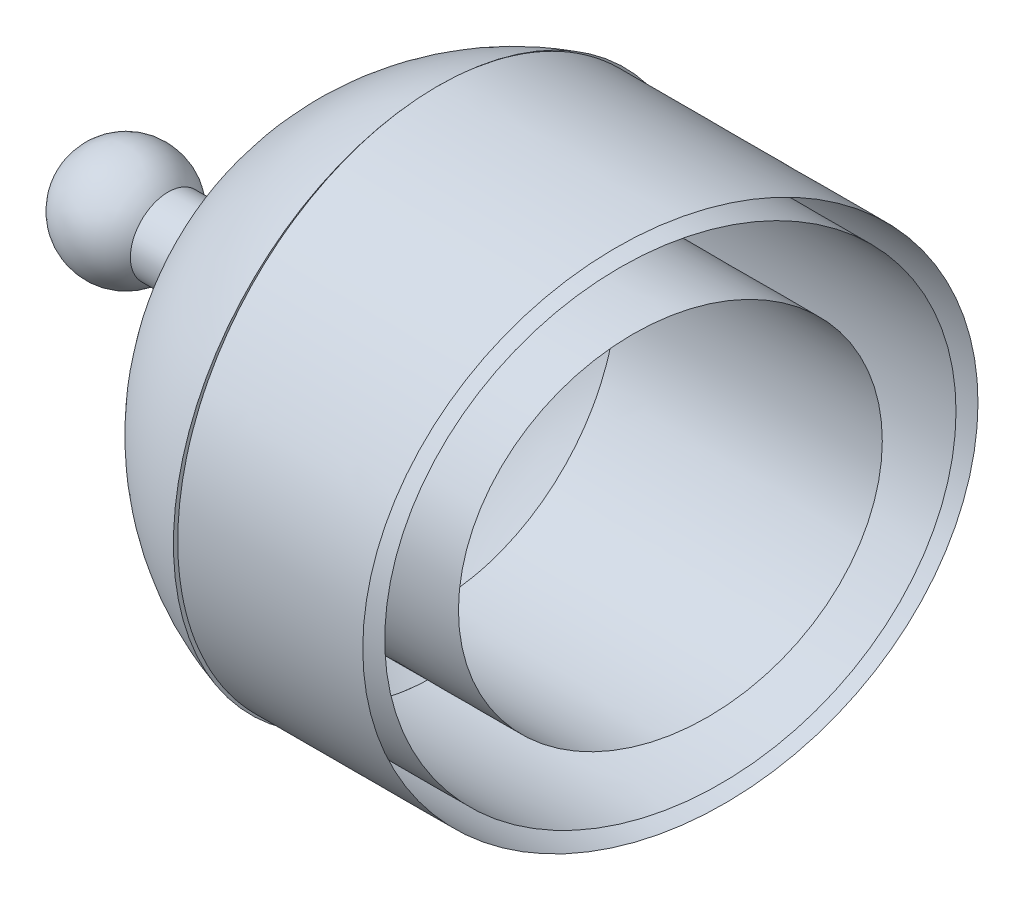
ISO-10303-21;
HEADER;
FILE_DESCRIPTION(('STEP AP214'),'2;1');
FILE_NAME('part.step','',(''),(''),'','','');
FILE_SCHEMA(('AUTOMOTIVE_DESIGN { 1 0 10303 214 1 1 1 1 }'));
ENDSEC;
DATA;
#1=APPLICATION_CONTEXT('core data for automotive mechanical design processes');
#2=APPLICATION_PROTOCOL_DEFINITION('international standard','automotive_design',2000,#1);
#3=PRODUCT_CONTEXT('',#1,'mechanical');
#4=PRODUCT('Part','Part','',(#3));
#5=PRODUCT_RELATED_PRODUCT_CATEGORY('part','',(#4));
#6=PRODUCT_DEFINITION_FORMATION('','',#4);
#7=PRODUCT_DEFINITION_CONTEXT('part definition',#1,'design');
#8=PRODUCT_DEFINITION('design','',#6,#7);
#9=PRODUCT_DEFINITION_SHAPE('','',#8);
#10=(LENGTH_UNIT() NAMED_UNIT(*) SI_UNIT(.MILLI.,.METRE.));
#11=(NAMED_UNIT(*) PLANE_ANGLE_UNIT() SI_UNIT($,.RADIAN.));
#12=(NAMED_UNIT(*) SI_UNIT($,.STERADIAN.) SOLID_ANGLE_UNIT());
#13=UNCERTAINTY_MEASURE_WITH_UNIT(LENGTH_MEASURE(1.E-05),#10,'distance_accuracy_value','');
#14=(GEOMETRIC_REPRESENTATION_CONTEXT(3) GLOBAL_UNCERTAINTY_ASSIGNED_CONTEXT((#13)) GLOBAL_UNIT_ASSIGNED_CONTEXT((#10,
#11,#12)) REPRESENTATION_CONTEXT('',''));
#15=CARTESIAN_POINT('',(0.,0.,0.));
#16=DIRECTION('',(0.,0.,1.));
#17=DIRECTION('',(1.,0.,0.));
#18=AXIS2_PLACEMENT_3D('',#15,#16,#17);
#19=CARTESIAN_POINT('',(6.93653758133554,0.,0.));
#20=DIRECTION('',(0.983583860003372,-0.00254509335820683,0.180433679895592));
#21=DIRECTION('',(0.18043426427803,0.,-0.983587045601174));
#22=AXIS2_PLACEMENT_3D('',#19,#20,#21);
#23=CIRCLE('',#22,3.50000000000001);
#24=DIRECTION('',(-1.,0.,0.));
#25=VECTOR('',#24,1.);
#26=SURFACE_OF_LINEAR_EXTRUSION('',#23,#25);
#27=CARTESIAN_POINT('',(7.56805750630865,0.,-3.44255465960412));
#28=VERTEX_POINT('',#27);
#29=EDGE_CURVE('E48',#28,#28,#23,.T.);
#30=ORIENTED_EDGE('',*,*,#29,.T.);
#31=EDGE_LOOP('',(#30));
#32=FACE_BOUND('',#31,.T.);
#33=CARTESIAN_POINT('',(3.85486874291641,0.,-3.44255465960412));
#34=CARTESIAN_POINT('',(3.85486874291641,-0.0978764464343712,-3.44260255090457));
#35=CARTESIAN_POINT('',(3.85486874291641,-0.195724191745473,-3.43860718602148));
#36=CARTESIAN_POINT('',(3.85486874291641,-0.391094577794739,-3.42253563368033));
#37=CARTESIAN_POINT('',(3.85486874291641,-0.488615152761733,-3.41043343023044));
#38=CARTESIAN_POINT('',(3.85486874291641,-0.682335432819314,-3.3781994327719));
#39=CARTESIAN_POINT('',(3.85486874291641,-0.778534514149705,-3.35806397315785));
#40=CARTESIAN_POINT('',(3.85486874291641,-1.06373496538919,-3.28585584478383));
#41=CARTESIAN_POINT('',(3.85486874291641,-1.24989076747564,-3.22193567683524));
#42=CARTESIAN_POINT('',(3.85486874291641,-1.60780020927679,-3.06460947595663));
#43=CARTESIAN_POINT('',(3.85486874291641,-1.77963652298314,-2.97139005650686));
#44=CARTESIAN_POINT('',(3.85486874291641,-2.10423513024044,-2.75850636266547));
#45=CARTESIAN_POINT('',(3.85486874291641,-2.25713271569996,-2.63904888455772));
#46=CARTESIAN_POINT('',(3.85486874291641,-2.5397978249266,-2.37745244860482));
#47=CARTESIAN_POINT('',(3.85486874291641,-2.66974359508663,-2.23550615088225));
#48=CARTESIAN_POINT('',(3.85486874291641,-2.90333664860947,-1.93316582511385));
#49=CARTESIAN_POINT('',(3.85486874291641,-3.00718074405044,-1.77292397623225));
#50=CARTESIAN_POINT('',(3.85486874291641,-3.1862212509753,-1.43851392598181));
#51=CARTESIAN_POINT('',(3.85486874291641,-3.26160178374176,-1.26444436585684));
#52=CARTESIAN_POINT('',(3.85486874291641,-3.38214477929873,-0.907041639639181));
#53=CARTESIAN_POINT('',(3.85486874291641,-3.42744719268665,-0.723755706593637));
#54=CARTESIAN_POINT('',(3.85486874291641,-3.4869685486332,-0.352632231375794));
#55=CARTESIAN_POINT('',(3.85486874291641,-3.50125853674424,-0.164806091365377));
#56=CARTESIAN_POINT('',(3.85486874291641,-3.49854132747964,0.21061807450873));
#57=CARTESIAN_POINT('',(3.85486874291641,-3.48153410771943,0.39821610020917));
#58=CARTESIAN_POINT('',(3.85486874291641,-3.41673929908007,0.768016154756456));
#59=CARTESIAN_POINT('',(3.85486874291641,-3.36895225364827,0.950218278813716));
#60=CARTESIAN_POINT('',(3.85486874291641,-3.24406068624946,1.30423818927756));
#61=CARTESIAN_POINT('',(3.85486874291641,-3.16695715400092,1.47605632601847));
#62=CARTESIAN_POINT('',(3.85486874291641,-2.98562311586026,1.80481309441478));
#63=CARTESIAN_POINT('',(3.85486874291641,-2.88139384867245,1.9617524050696));
#64=CARTESIAN_POINT('',(3.85486874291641,-2.70712214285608,2.18277830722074));
#65=CARTESIAN_POINT('',(3.85486874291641,-2.64601289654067,2.25408451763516));
#66=CARTESIAN_POINT('',(3.85486874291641,-2.51821336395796,2.39150993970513));
#67=CARTESIAN_POINT('',(3.85486874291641,-2.45152424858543,2.45763023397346));
#68=CARTESIAN_POINT('',(3.85486874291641,-2.31304838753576,2.58423829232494));
#69=CARTESIAN_POINT('',(3.85486874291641,-2.24126365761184,2.6447282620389));
#70=CARTESIAN_POINT('',(3.85486874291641,-2.0930169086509,2.75978030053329));
#71=CARTESIAN_POINT('',(3.85486874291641,-2.01655089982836,2.81433719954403));
#72=CARTESIAN_POINT('',(3.85486874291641,-1.77897037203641,2.96982026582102));
#73=CARTESIAN_POINT('',(3.85486874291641,-1.61134826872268,3.0610287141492));
#74=CARTESIAN_POINT('',(3.85486874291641,-1.26359874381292,3.21526590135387));
#75=CARTESIAN_POINT('',(3.85486874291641,-1.08346979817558,3.27829119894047));
#76=CARTESIAN_POINT('',(3.85486874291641,-0.804939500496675,3.35129485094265));
#77=CARTESIAN_POINT('',(3.85486874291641,-0.709275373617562,3.37217547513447));
#78=CARTESIAN_POINT('',(3.85486874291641,-0.516619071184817,3.40596573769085));
#79=CARTESIAN_POINT('',(3.85486874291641,-0.419628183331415,3.41888261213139));
#80=CARTESIAN_POINT('',(3.85486874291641,-0.224878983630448,3.43668473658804));
#81=CARTESIAN_POINT('',(3.85486874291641,-0.127120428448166,3.44156732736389));
#82=CARTESIAN_POINT('',(3.85486874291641,0.0684646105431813,3.44327333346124));
#83=CARTESIAN_POINT('',(3.85486874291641,0.166291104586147,3.44009496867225));
#84=CARTESIAN_POINT('',(3.85486874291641,0.458833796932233,3.41845936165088));
#85=CARTESIAN_POINT('',(3.85486874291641,0.652801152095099,3.38791862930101));
#86=CARTESIAN_POINT('',(3.85486874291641,1.03297057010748,3.29532558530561));
#87=CARTESIAN_POINT('',(3.85486874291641,1.21917243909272,3.23327248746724));
#88=CARTESIAN_POINT('',(3.85486874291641,1.57813185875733,3.07947171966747));
#89=CARTESIAN_POINT('',(3.85486874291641,1.75093504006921,2.98783086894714));
#90=CARTESIAN_POINT('',(3.85486874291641,2.07768173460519,2.77791531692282));
#91=CARTESIAN_POINT('',(3.85486874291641,2.23175809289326,2.65984745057));
#92=CARTESIAN_POINT('',(3.85486874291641,2.51699521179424,2.4008018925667));
#93=CARTESIAN_POINT('',(3.85486874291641,2.64833226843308,2.26001847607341));
#94=CARTESIAN_POINT('',(3.85486874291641,2.88486255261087,1.95975551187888));
#95=CARTESIAN_POINT('',(3.85486874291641,2.99025235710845,1.80043091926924));
#96=CARTESIAN_POINT('',(3.85486874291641,3.17249630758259,1.46759477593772));
#97=CARTESIAN_POINT('',(3.85486874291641,3.24953616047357,1.29418497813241));
#98=CARTESIAN_POINT('',(3.85486874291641,3.37346698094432,0.937836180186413));
#99=CARTESIAN_POINT('',(3.85486874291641,3.42050114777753,0.754947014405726));
#100=CARTESIAN_POINT('',(3.85486874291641,3.48351722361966,0.38435030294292));
#101=CARTESIAN_POINT('',(3.85486874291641,3.49957454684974,0.19665558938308));
#102=CARTESIAN_POINT('',(3.85486874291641,3.50038695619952,-0.1788004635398));
#103=CARTESIAN_POINT('',(3.85486874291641,3.48514198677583,-0.366561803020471));
#104=CARTESIAN_POINT('',(3.85486874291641,3.42381340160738,-0.736976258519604));
#105=CARTESIAN_POINT('',(3.85486874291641,3.37773029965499,-0.919629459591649));
#106=CARTESIAN_POINT('',(3.85486874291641,3.25613843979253,-1.27482145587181));
#107=CARTESIAN_POINT('',(3.85486874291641,3.18063065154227,-1.44736058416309));
#108=CARTESIAN_POINT('',(3.85486874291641,3.00233703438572,-1.77780371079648));
#109=CARTESIAN_POINT('',(3.85486874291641,2.89955243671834,-1.93570836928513));
#110=CARTESIAN_POINT('',(3.85486874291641,2.72730729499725,-2.15833756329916));
#111=CARTESIAN_POINT('',(3.85486874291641,2.6668511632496,-2.23020366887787));
#112=CARTESIAN_POINT('',(3.85486874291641,2.54030487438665,-2.36880046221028));
#113=CARTESIAN_POINT('',(3.85486874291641,2.47421564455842,-2.43553199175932));
#114=CARTESIAN_POINT('',(3.85486874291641,2.3368799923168,-2.56341033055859));
#115=CARTESIAN_POINT('',(3.85486874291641,2.26563523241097,-2.62455892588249));
#116=CARTESIAN_POINT('',(3.85486874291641,2.11842664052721,-2.74095496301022));
#117=CARTESIAN_POINT('',(3.85486874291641,2.04245965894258,-2.79619839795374));
#118=CARTESIAN_POINT('',(3.85486874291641,1.80636367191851,-2.95376668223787));
#119=CARTESIAN_POINT('',(3.85486874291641,1.63963825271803,-3.04644225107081));
#120=CARTESIAN_POINT('',(3.85486874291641,1.29329922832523,-3.20381942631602));
#121=CARTESIAN_POINT('',(3.85486874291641,1.11367019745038,-3.2684868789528));
#122=CARTESIAN_POINT('',(3.85486874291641,0.778559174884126,-3.35950577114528));
#123=CARTESIAN_POINT('',(3.85486874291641,0.624339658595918,-3.39057681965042));
#124=CARTESIAN_POINT('',(3.85486874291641,0.313385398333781,-3.43204352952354));
#125=CARTESIAN_POINT('',(3.85486874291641,0.156655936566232,-3.44247800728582));
#126=CARTESIAN_POINT('',(3.85486874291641,0.,-3.44255465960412));
#127=B_SPLINE_CURVE_WITH_KNOTS('',3,(#33,#34,#35,#36,#37,#38,#39,#40,#41,#42,#43,#44,#45,#46,
#47,#48,#49,#50,#51,#52,#53,#54,#55,#56,#57,#58,#59,#60,#61,#62,#63,#64,#65,#66,#67,#68,#69,#70,
#71,#72,#73,#74,#75,#76,#77,#78,#79,#80,#81,#82,#83,#84,#85,#86,#87,#88,#89,#90,#91,#92,#93,#94,
#95,#96,#97,#98,#99,#100,#101,#102,#103,#104,#105,#106,#107,#108,#109,#110,#111,#112,#113,#114,
#115,#116,#117,#118,#119,#120,#121,#122,#123,#124,#125,#126),.UNSPECIFIED.,.T.,.F.,(4,2,2,2,2,2,
2,2,2,2,2,2,2,2,2,2,2,2,2,2,2,2,2,2,2,2,2,2,2,2,2,2,2,2,2,2,2,2,2,2,2,2,2,2,2,2,4),(0.,
0.293496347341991,0.587939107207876,0.882516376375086,1.47003173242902,2.05387841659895,
2.63327883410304,3.20796016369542,3.77816869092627,4.34462282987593,4.90842248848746,
5.47092918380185,6.03343628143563,6.59593344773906,7.15841162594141,7.72086412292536,
8.00233714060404,8.28375124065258,8.56505463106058,8.84660120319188,9.41642042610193,
9.98630920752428,10.2797757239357,10.572975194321,10.8662716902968,11.1596329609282,
11.7457961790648,12.3319740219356,12.9160588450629,13.4957228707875,14.0706692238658,
14.6411155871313,15.2077557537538,15.7716710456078,16.3342117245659,16.8967534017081,
17.4592857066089,18.0217994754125,18.5842878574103,18.8657727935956,19.1472114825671,
19.4285598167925,19.7100978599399,20.2796480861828,20.8498908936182,21.3205319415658,
21.7902868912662),.UNSPECIFIED.);
#128=CARTESIAN_POINT('',(3.85486874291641,0.,-3.44255465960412));
#129=VERTEX_POINT('',#128);
#130=EDGE_CURVE('E11',#129,#129,#127,.T.);
#131=ORIENTED_EDGE('',*,*,#130,.T.);
#132=EDGE_LOOP('',(#131));
#133=FACE_BOUND('',#132,.T.);
#134=ADVANCED_FACE('F40',(#32,#133),#26,.T.);
#135=OPEN_SHELL('',(#134));
#136=SHELL_BASED_SURFACE_MODEL('B2',(#135));
#137=CARTESIAN_POINT('',(6.93653758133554,0.,0.));
#138=DIRECTION('',(0.983583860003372,-0.00254509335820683,0.180433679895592));
#139=DIRECTION('',(0.18043426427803,0.,-0.983587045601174));
#140=AXIS2_PLACEMENT_3D('',#137,#138,#139);
#141=CIRCLE('',#140,2.41126843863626);
#142=DIRECTION('',(-1.,0.,0.));
#143=VECTOR('',#142,1.);
#144=SURFACE_OF_LINEAR_EXTRUSION('',#141,#143);
#145=CARTESIAN_POINT('',(7.37161302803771,0.,-2.3716923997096));
#146=VERTEX_POINT('',#145);
#147=EDGE_CURVE('E87',#146,#146,#141,.T.);
#148=ORIENTED_EDGE('',*,*,#147,.T.);
#149=EDGE_LOOP('',(#148));
#150=FACE_BOUND('',#149,.T.);
#151=CARTESIAN_POINT('',(3.85486874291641,0.,-2.37169239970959));
#152=CARTESIAN_POINT('',(3.85486874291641,-0.0674249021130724,-2.3717269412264));
#153=CARTESIAN_POINT('',(3.85486874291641,-0.134824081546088,-2.36897760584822));
#154=CARTESIAN_POINT('',(3.85486874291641,-0.336794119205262,-2.35235305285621));
#155=CARTESIAN_POINT('',(3.85486874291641,-0.470785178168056,-2.33007219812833));
#156=CARTESIAN_POINT('',(3.85486874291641,-0.732942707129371,-2.26372589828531));
#157=CARTESIAN_POINT('',(3.85486874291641,-0.861118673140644,-2.21969747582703));
#158=CARTESIAN_POINT('',(3.85486874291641,-1.10764151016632,-2.11131619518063));
#159=CARTESIAN_POINT('',(3.85486874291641,-1.22604475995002,-2.04709196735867));
#160=CARTESIAN_POINT('',(3.85486874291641,-1.44968579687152,-1.90042757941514));
#161=CARTESIAN_POINT('',(3.85486874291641,-1.55501697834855,-1.81812986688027));
#162=CARTESIAN_POINT('',(3.85486874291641,-1.74975081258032,-1.63790765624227));
#163=CARTESIAN_POINT('',(3.85486874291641,-1.83927621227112,-1.54011589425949));
#164=CARTESIAN_POINT('',(3.85486874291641,-2.00020735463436,-1.33182329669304));
#165=CARTESIAN_POINT('',(3.85486874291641,-2.071748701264,-1.22142730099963));
#166=CARTESIAN_POINT('',(3.85486874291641,-2.19509551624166,-0.991040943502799));
#167=CARTESIAN_POINT('',(3.85486874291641,-2.24702782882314,-0.871118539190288));
#168=CARTESIAN_POINT('',(3.85486874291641,-2.33007400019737,-0.62489165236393));
#169=CARTESIAN_POINT('',(3.85486874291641,-2.3612842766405,-0.498619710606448));
#170=CARTESIAN_POINT('',(3.85486874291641,-2.40229070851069,-0.242940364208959));
#171=CARTESIAN_POINT('',(3.85486874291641,-2.41213580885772,-0.113540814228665));
#172=CARTESIAN_POINT('',(3.85486874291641,-2.41026318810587,0.145102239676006));
#173=CARTESIAN_POINT('',(3.85486874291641,-2.3985454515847,0.27434574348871));
#174=CARTESIAN_POINT('',(3.85486874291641,-2.35390853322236,0.529111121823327));
#175=CARTESIAN_POINT('',(3.85486874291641,-2.32098972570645,0.654633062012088));
#176=CARTESIAN_POINT('',(3.85486874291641,-2.23493867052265,0.898538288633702));
#177=CARTESIAN_POINT('',(3.85486874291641,-2.18180710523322,1.01692181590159));
#178=CARTESIAN_POINT('',(3.85486874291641,-2.056913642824,1.24338015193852));
#179=CARTESIAN_POINT('',(3.85486874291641,-1.98515259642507,1.35145543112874));
#180=CARTESIAN_POINT('',(3.85486874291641,-1.82499561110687,1.55454476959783));
#181=CARTESIAN_POINT('',(3.85486874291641,-1.73660054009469,1.64955950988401));
#182=CARTESIAN_POINT('',(3.85486874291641,-1.5935265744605,1.78038273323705));
#183=CARTESIAN_POINT('',(3.85486874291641,-1.54407943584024,1.82204650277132));
#184=CARTESIAN_POINT('',(3.85486874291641,-1.44195311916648,1.9013023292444));
#185=CARTESIAN_POINT('',(3.85486874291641,-1.38927118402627,1.93889083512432));
#186=CARTESIAN_POINT('',(3.85486874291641,-1.22559080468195,2.04601230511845));
#187=CARTESIAN_POINT('',(3.85486874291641,-1.11011180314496,2.10884695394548));
#188=CARTESIAN_POINT('',(3.85486874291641,-0.870536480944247,2.21510479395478));
#189=CARTESIAN_POINT('',(3.85486874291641,-0.746439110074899,2.25852561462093));
#190=CARTESIAN_POINT('',(3.85486874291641,-0.554550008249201,2.30882049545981));
#191=CARTESIAN_POINT('',(3.85486874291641,-0.488643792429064,2.32320581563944));
#192=CARTESIAN_POINT('',(3.85486874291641,-0.355916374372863,2.34648503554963));
#193=CARTESIAN_POINT('',(3.85486874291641,-0.289096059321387,2.35538392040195));
#194=CARTESIAN_POINT('',(3.85486874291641,-0.154926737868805,2.3676484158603));
#195=CARTESIAN_POINT('',(3.85486874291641,-0.0875775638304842,2.3710121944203));
#196=CARTESIAN_POINT('',(3.85486874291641,0.0471675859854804,2.37218751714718));
#197=CARTESIAN_POINT('',(3.85486874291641,0.114563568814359,2.36999783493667));
#198=CARTESIAN_POINT('',(3.85486874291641,0.316106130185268,2.35509233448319));
#199=CARTESIAN_POINT('',(3.85486874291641,0.449736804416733,2.33405178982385));
#200=CARTESIAN_POINT('',(3.85486874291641,0.711648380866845,2.27026130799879));
#201=CARTESIAN_POINT('',(3.85486874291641,0.839929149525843,2.22751082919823));
#202=CARTESIAN_POINT('',(3.85486874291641,1.08722844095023,2.12155227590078));
#203=CARTESIAN_POINT('',(3.85486874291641,1.20627840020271,2.05841779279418));
#204=CARTESIAN_POINT('',(3.85486874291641,1.4313852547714,1.91379986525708));
#205=CARTESIAN_POINT('',(3.85486874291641,1.53753367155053,1.83245891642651));
#206=CARTESIAN_POINT('',(3.85486874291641,1.73404317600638,1.65399366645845));
#207=CARTESIAN_POINT('',(3.85486874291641,1.82452571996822,1.55700320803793));
#208=CARTESIAN_POINT('',(3.85486874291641,1.98747943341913,1.35014188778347));
#209=CARTESIAN_POINT('',(3.85486874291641,2.06008603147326,1.24037777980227));
#210=CARTESIAN_POINT('',(3.85486874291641,2.18564006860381,1.01107571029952));
#211=CARTESIAN_POINT('',(3.85486874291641,2.23871544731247,0.891607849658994));
#212=CARTESIAN_POINT('',(3.85486874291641,2.32409553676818,0.646107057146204));
#213=CARTESIAN_POINT('',(3.85486874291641,2.35649890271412,0.520108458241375));
#214=CARTESIAN_POINT('',(3.85486874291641,2.39991298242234,0.264792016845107));
#215=CARTESIAN_POINT('',(3.85486874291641,2.41097565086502,0.135483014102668));
#216=CARTESIAN_POINT('',(3.85486874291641,2.41153470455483,-0.123182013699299));
#217=CARTESIAN_POINT('',(3.85486874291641,2.40103105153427,-0.252538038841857));
#218=CARTESIAN_POINT('',(3.85486874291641,2.35878211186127,-0.507726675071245));
#219=CARTESIAN_POINT('',(3.85486874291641,2.32703717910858,-0.633559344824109));
#220=CARTESIAN_POINT('',(3.85486874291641,2.24325948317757,-0.878272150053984));
#221=CARTESIAN_POINT('',(3.85486874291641,2.19122738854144,-0.997152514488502));
#222=CARTESIAN_POINT('',(3.85486874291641,2.06842827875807,-1.22477230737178));
#223=CARTESIAN_POINT('',(3.85486874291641,1.99766210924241,-1.33351219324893));
#224=CARTESIAN_POINT('',(3.85486874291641,1.83936604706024,-1.53807653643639));
#225=CARTESIAN_POINT('',(3.85486874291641,1.75183702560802,-1.63390166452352));
#226=CARTESIAN_POINT('',(3.85486874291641,1.60994506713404,-1.76603376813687));
#227=CARTESIAN_POINT('',(3.85486874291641,1.56086986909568,-1.80815119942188));
#228=CARTESIAN_POINT('',(3.85486874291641,1.45945871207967,-1.88833288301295));
#229=CARTESIAN_POINT('',(3.85486874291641,1.40712057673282,-1.92639438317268));
#230=CARTESIAN_POINT('',(3.85486874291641,1.2444630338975,-2.03495248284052));
#231=CARTESIAN_POINT('',(3.85486874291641,1.12960194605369,-2.09879792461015));
#232=CARTESIAN_POINT('',(3.85486874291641,0.890997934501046,-2.20721885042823));
#233=CARTESIAN_POINT('',(3.85486874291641,0.767244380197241,-2.25177080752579));
#234=CARTESIAN_POINT('',(3.85486874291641,0.536376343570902,-2.31447754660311));
#235=CARTESIAN_POINT('',(3.85486874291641,0.430131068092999,-2.33588381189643));
#236=CARTESIAN_POINT('',(3.85486874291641,0.215899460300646,-2.36445022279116));
#237=CARTESIAN_POINT('',(3.85486874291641,0.10791678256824,-2.37163711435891));
#238=CARTESIAN_POINT('',(3.85486874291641,0.,-2.37169239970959));
#239=B_SPLINE_CURVE_WITH_KNOTS('',3,(#151,#152,#153,#154,#155,#156,#157,#158,#159,#160,#161,
#162,#163,#164,#165,#166,#167,#168,#169,#170,#171,#172,#173,#174,#175,#176,#177,#178,#179,#180,
#181,#182,#183,#184,#185,#186,#187,#188,#189,#190,#191,#192,#193,#194,#195,#196,#197,#198,#199,
#200,#201,#202,#203,#204,#205,#206,#207,#208,#209,#210,#211,#212,#213,#214,#215,#216,#217,#218,
#219,#220,#221,#222,#223,#224,#225,#226,#227,#228,#229,#230,#231,#232,#233,#234,#235,#236,#237,
#238),.UNSPECIFIED.,.T.,.F.,(4,2,2,2,2,2,2,2,2,2,2,2,2,2,2,2,2,2,2,2,2,2,2,2,2,2,2,2,2,2,2,2,2,
2,2,2,2,2,2,2,2,2,2,4),(0.,0.202199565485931,0.607646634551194,1.01240584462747,
1.41463758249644,1.81380613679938,2.20972355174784,2.60255950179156,2.99280892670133,
3.38122959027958,3.76875948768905,4.15628966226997,4.54381299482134,4.93132324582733,
5.31881580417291,5.70628815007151,5.9000875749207,6.09405453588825,6.48662228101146,
6.87923794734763,7.08141696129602,7.28341199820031,7.48547387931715,7.68758038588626,
8.09140806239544,8.49524581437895,8.89764161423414,9.29699177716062,9.69309177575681,
10.0860915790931,10.4764691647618,10.8649694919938,11.2525228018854,11.6400767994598,
12.0276243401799,12.4151591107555,12.8026763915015,13.190173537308,13.3840039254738,
13.5779650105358,13.9703474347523,14.3632070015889,14.6874475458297,15.0110776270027),.UNSPECIFIED.);
#240=CARTESIAN_POINT('',(3.85486874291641,0.,-2.37169239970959));
#241=VERTEX_POINT('',#240);
#242=EDGE_CURVE('E39',#241,#241,#239,.T.);
#243=ORIENTED_EDGE('',*,*,#242,.T.);
#244=EDGE_LOOP('',(#243));
#245=FACE_BOUND('',#244,.T.);
#246=ADVANCED_FACE('F79',(#150,#245),#144,.T.);
#247=OPEN_SHELL('',(#246));
#248=SHELL_BASED_SURFACE_MODEL('B6',(#247));
#249=CARTESIAN_POINT('',(6.93653758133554,0.,0.));
#250=DIRECTION('',(0.983583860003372,-0.00254509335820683,0.180433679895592));
#251=DIRECTION('',(0.18043426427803,0.,-0.983587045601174));
#252=AXIS2_PLACEMENT_3D('',#249,#250,#251);
#253=CIRCLE('',#252,3.25);
#254=DIRECTION('',(-1.,0.,0.));
#255=VECTOR('',#254,1.);
#256=SURFACE_OF_LINEAR_EXTRUSION('',#253,#255);
#257=CARTESIAN_POINT('',(7.52294894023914,0.,-3.19665789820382));
#258=VERTEX_POINT('',#257);
#259=EDGE_CURVE('E125',#258,#258,#253,.T.);
#260=ORIENTED_EDGE('',*,*,#259,.T.);
#261=EDGE_LOOP('',(#260));
#262=FACE_BOUND('',#261,.T.);
#263=CARTESIAN_POINT('',(3.85486874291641,0.,-3.19665789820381));
#264=CARTESIAN_POINT('',(3.85486874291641,-0.0908778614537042,-3.19670444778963));
#265=CARTESIAN_POINT('',(3.85486874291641,-0.181721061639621,-3.1929987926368));
#266=CARTESIAN_POINT('',(3.85486874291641,-0.45394402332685,-3.17059159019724));
#267=CARTESIAN_POINT('',(3.85486874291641,-0.634542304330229,-3.14056059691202));
#268=CARTESIAN_POINT('',(3.85486874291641,-0.98788826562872,-3.0511365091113));
#269=CARTESIAN_POINT('',(3.85486874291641,-1.16064874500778,-2.99179331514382));
#270=CARTESIAN_POINT('',(3.85486874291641,-1.4929216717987,-2.84571287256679));
#271=CARTESIAN_POINT('',(3.85486874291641,-1.65251010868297,-2.75914899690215));
#272=CARTESIAN_POINT('',(3.85486874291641,-1.95394206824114,-2.56146911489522));
#273=CARTESIAN_POINT('',(3.85486874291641,-2.09591147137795,-2.45054510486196));
#274=CARTESIAN_POINT('',(3.85486874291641,-2.35838119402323,-2.20763470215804));
#275=CARTESIAN_POINT('',(3.85486874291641,-2.47904695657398,-2.07582721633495));
#276=CARTESIAN_POINT('',(3.85486874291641,-2.69595612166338,-1.79508247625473));
#277=CARTESIAN_POINT('',(3.85486874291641,-2.79238229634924,-1.64628652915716));
#278=CARTESIAN_POINT('',(3.85486874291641,-2.9586338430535,-1.33576295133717));
#279=CARTESIAN_POINT('',(3.85486874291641,-3.02863018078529,-1.17412691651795));
#280=CARTESIAN_POINT('',(3.85486874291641,-3.14056305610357,-0.842252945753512));
#281=CARTESIAN_POINT('',(3.85486874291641,-3.18262954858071,-0.672058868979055));
#282=CARTESIAN_POINT('',(3.85486874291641,-3.23789935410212,-0.327444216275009));
#283=CARTESIAN_POINT('',(3.85486874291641,-3.25116863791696,-0.153034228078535));
#284=CARTESIAN_POINT('',(3.85486874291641,-3.24864552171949,0.195573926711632));
#285=CARTESIAN_POINT('',(3.85486874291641,-3.23285310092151,0.369772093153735));
#286=CARTESIAN_POINT('',(3.85486874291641,-3.17268649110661,0.713157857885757));
#287=CARTESIAN_POINT('',(3.85486874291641,-3.12831280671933,0.88234554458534));
#288=CARTESIAN_POINT('',(3.85486874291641,-3.01234206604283,1.21107831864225));
#289=CARTESIAN_POINT('',(3.85486874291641,-2.94074592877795,1.37062373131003));
#290=CARTESIAN_POINT('',(3.85486874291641,-2.77236432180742,1.67589787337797));
#291=CARTESIAN_POINT('',(3.85486874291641,-2.67558000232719,1.82162723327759));
#292=CARTESIAN_POINT('',(3.85486874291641,-2.51375627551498,2.02686557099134));
#293=CARTESIAN_POINT('',(3.85486874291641,-2.45701197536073,2.09307848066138));
#294=CARTESIAN_POINT('',(3.85486874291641,-2.33834098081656,2.22068780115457));
#295=CARTESIAN_POINT('',(3.85486874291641,-2.27641537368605,2.28208521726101));
#296=CARTESIAN_POINT('',(3.85486874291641,-2.14783064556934,2.39964984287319));
#297=CARTESIAN_POINT('',(3.85486874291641,-2.08117339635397,2.45581910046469));
#298=CARTESIAN_POINT('',(3.85486874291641,-1.94351570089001,2.56265313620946));
#299=CARTESIAN_POINT('',(3.85486874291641,-1.87251154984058,2.6133131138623));
#300=CARTESIAN_POINT('',(3.85486874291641,-1.65190105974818,2.7576902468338));
#301=CARTESIAN_POINT('',(3.85486874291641,-1.49625196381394,2.84238380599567));
#302=CARTESIAN_POINT('',(3.85486874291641,-1.17334169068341,2.98560405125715));
#303=CARTESIAN_POINT('',(3.85486874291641,-1.00607909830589,3.04412754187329));
#304=CARTESIAN_POINT('',(3.85486874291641,-0.747443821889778,3.11191664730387));
#305=CARTESIAN_POINT('',(3.85486874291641,-0.6586128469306,3.13130579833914));
#306=CARTESIAN_POINT('',(3.85486874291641,-0.479717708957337,3.16268247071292));
#307=CARTESIAN_POINT('',(3.85486874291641,-0.389654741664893,3.17467671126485));
#308=CARTESIAN_POINT('',(3.85486874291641,-0.208816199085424,3.19120725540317));
#309=CARTESIAN_POINT('',(3.85486874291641,-0.118040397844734,3.19574108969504));
#310=CARTESIAN_POINT('',(3.85486874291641,0.0635742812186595,3.197325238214));
#311=CARTESIAN_POINT('',(3.85486874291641,0.154413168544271,3.19437389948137));
#312=CARTESIAN_POINT('',(3.85486874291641,0.426059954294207,3.17428369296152));
#313=CARTESIAN_POINT('',(3.85486874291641,0.60617249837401,3.14592444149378));
#314=CARTESIAN_POINT('',(3.85486874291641,0.959186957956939,3.05994518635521));
#315=CARTESIAN_POINT('',(3.85486874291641,1.13208869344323,3.00232445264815));
#316=CARTESIAN_POINT('',(3.85486874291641,1.46540815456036,2.85950945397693));
#317=CARTESIAN_POINT('',(3.85486874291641,1.62586825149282,2.77441437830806));
#318=CARTESIAN_POINT('',(3.85486874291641,1.9292758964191,2.57949279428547));
#319=CARTESIAN_POINT('',(3.85486874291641,2.07234680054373,2.46985834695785));
#320=CARTESIAN_POINT('',(3.85486874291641,2.33720983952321,2.22931604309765));
#321=CARTESIAN_POINT('',(3.85486874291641,2.4591656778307,2.09858858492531));
#322=CARTESIAN_POINT('',(3.85486874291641,2.67880094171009,1.8197729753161));
#323=CARTESIAN_POINT('',(3.85486874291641,2.7766629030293,1.67182871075));
#324=CARTESIAN_POINT('',(3.85486874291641,2.9458894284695,1.36276657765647));
#325=CARTESIAN_POINT('',(3.85486874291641,3.01742643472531,1.20174319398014));
#326=CARTESIAN_POINT('',(3.85486874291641,3.13250505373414,0.870847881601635));
#327=CARTESIAN_POINT('',(3.85486874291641,3.17617963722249,0.701022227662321));
#328=CARTESIAN_POINT('',(3.85486874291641,3.23469456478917,0.356896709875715));
#329=CARTESIAN_POINT('',(3.85486874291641,3.24960493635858,0.182608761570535));
#330=CARTESIAN_POINT('',(3.85486874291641,3.25035931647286,-0.166029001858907));
#331=CARTESIAN_POINT('',(3.85486874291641,3.2362032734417,-0.340378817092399));
#332=CARTESIAN_POINT('',(3.85486874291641,3.17925530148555,-0.6843350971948));
#333=CARTESIAN_POINT('',(3.85486874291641,3.13646384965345,-0.853941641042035));
#334=CARTESIAN_POINT('',(3.85486874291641,3.02355712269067,-1.18376278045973));
#335=CARTESIAN_POINT('',(3.85486874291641,2.95344274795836,-1.3439776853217));
#336=CARTESIAN_POINT('',(3.85486874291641,2.78788438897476,-1.65081773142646));
#337=CARTESIAN_POINT('',(3.85486874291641,2.69244154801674,-1.79744348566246));
#338=CARTESIAN_POINT('',(3.85486874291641,2.53249963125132,-2.00417059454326));
#339=CARTESIAN_POINT('',(3.85486874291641,2.47636179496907,-2.07090340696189));
#340=CARTESIAN_POINT('',(3.85486874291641,2.35885452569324,-2.19960042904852));
#341=CARTESIAN_POINT('',(3.85486874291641,2.29748595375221,-2.2615654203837));
#342=CARTESIAN_POINT('',(3.85486874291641,2.16995999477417,-2.38030959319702));
#343=CARTESIAN_POINT('',(3.85486874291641,2.10380415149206,-2.43709043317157));
#344=CARTESIAN_POINT('',(3.85486874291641,1.96711044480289,-2.54517246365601));
#345=CARTESIAN_POINT('',(3.85486874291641,1.89656965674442,-2.59646993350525));
#346=CARTESIAN_POINT('',(3.85486874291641,1.67733774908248,-2.74278336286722));
#347=CARTESIAN_POINT('',(3.85486874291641,1.52252153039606,-2.82883931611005));
#348=CARTESIAN_POINT('',(3.85486874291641,1.20092041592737,-2.97497509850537));
#349=CARTESIAN_POINT('',(3.85486874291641,1.03412119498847,-3.03502321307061));
#350=CARTESIAN_POINT('',(3.85486874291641,0.722948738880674,-3.11954133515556));
#351=CARTESIAN_POINT('',(3.85486874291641,0.579747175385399,-3.14839366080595));
#352=CARTESIAN_POINT('',(3.85486874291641,0.290997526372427,-3.1868966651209));
#353=CARTESIAN_POINT('',(3.85486874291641,0.145454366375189,-3.19658339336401));
#354=CARTESIAN_POINT('',(3.85486874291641,0.,-3.19665789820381));
#355=B_SPLINE_CURVE_WITH_KNOTS('',3,(#263,#264,#265,#266,#267,#268,#269,#270,#271,#272,#273,
#274,#275,#276,#277,#278,#279,#280,#281,#282,#283,#284,#285,#286,#287,#288,#289,#290,#291,#292,
#293,#294,#295,#296,#297,#298,#299,#300,#301,#302,#303,#304,#305,#306,#307,#308,#309,#310,#311,
#312,#313,#314,#315,#316,#317,#318,#319,#320,#321,#322,#323,#324,#325,#326,#327,#328,#329,#330,
#331,#332,#333,#334,#335,#336,#337,#338,#339,#340,#341,#342,#343,#344,#345,#346,#347,#348,#349,
#350,#351,#352,#353,#354),.UNSPECIFIED.,.T.,.F.,(4,2,2,2,2,2,2,2,2,2,2,2,2,2,2,2,2,2,2,2,2,2,2,
2,2,2,2,2,2,2,2,2,2,2,2,2,2,2,2,2,2,2,2,2,2,4),(0.,0.272532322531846,0.8190094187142,
1.36455939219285,1.90670274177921,2.44471741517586,2.97835007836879,3.50782942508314,
4.03382255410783,4.55735080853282,5.07967845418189,5.60200647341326,6.12432527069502,
6.64662643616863,7.16890375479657,7.43027155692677,7.691584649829,7.95279494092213,
8.21423104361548,8.74334889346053,9.27253133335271,9.54503595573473,9.81729260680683,
10.08963935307,10.3620462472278,10.9063406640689,11.4506486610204,11.9930131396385,
12.5312725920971,13.065151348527,13.5948515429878,14.1210174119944,14.6446530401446,
15.1670122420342,15.6893723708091,16.2117237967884,16.7340580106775,17.256368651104,
17.5177475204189,17.7790834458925,18.0403354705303,18.3017636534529,18.8306317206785,
19.3601428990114,19.7971667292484,20.2333677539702),.UNSPECIFIED.);
#356=CARTESIAN_POINT('',(3.85486874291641,0.,-3.19665789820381));
#357=VERTEX_POINT('',#356);
#358=EDGE_CURVE('E78',#357,#357,#355,.T.);
#359=ORIENTED_EDGE('',*,*,#358,.T.);
#360=EDGE_LOOP('',(#359));
#361=FACE_BOUND('',#360,.T.);
#362=ADVANCED_FACE('F117',(#262,#361),#256,.T.);
#363=OPEN_SHELL('',(#362));
#364=SHELL_BASED_SURFACE_MODEL('B34',(#363));
#365=CARTESIAN_POINT('',(-0.581094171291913,0.,0.));
#366=DIRECTION('',(-1.,0.,0.));
#367=DIRECTION('',(0.,0.,1.));
#368=AXIS2_PLACEMENT_3D('',#365,#366,#367);
#369=CYLINDRICAL_SURFACE('',#368,0.5);
#370=CARTESIAN_POINT('',(0.284931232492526,0.,0.));
#371=DIRECTION('',(-1.,0.,0.));
#372=DIRECTION('',(0.,0.,1.));
#373=AXIS2_PLACEMENT_3D('',#370,#371,#372);
#374=CIRCLE('',#373,0.5);
#375=CARTESIAN_POINT('',(0.284931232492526,0.,0.5));
#376=VERTEX_POINT('',#375);
#377=EDGE_CURVE('E155',#376,#376,#374,.T.);
#378=ORIENTED_EDGE('',*,*,#377,.F.);
#379=EDGE_LOOP('',(#378));
#380=FACE_BOUND('',#379,.T.);
#381=CARTESIAN_POINT('',(1.25304279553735,0.,0.));
#382=DIRECTION('',(1.,0.,0.));
#383=DIRECTION('',(0.,0.,-1.));
#384=AXIS2_PLACEMENT_3D('',#381,#382,#383);
#385=CIRCLE('',#384,0.5);
#386=CARTESIAN_POINT('',(1.25304279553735,0.5,0.));
#387=VERTEX_POINT('',#386);
#388=EDGE_CURVE('E116',#387,#387,#385,.T.);
#389=ORIENTED_EDGE('',*,*,#388,.F.);
#390=EDGE_LOOP('',(#389));
#391=FACE_BOUND('',#390,.T.);
#392=ADVANCED_FACE('F148',(#380,#391),#369,.T.);
#393=CARTESIAN_POINT('',(-0.274085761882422,0.,0.));
#394=DIRECTION('',(-1.,0.,0.));
#395=DIRECTION('',(0.,1.,0.));
#396=AXIS2_PLACEMENT_3D('',#393,#394,#395);
#397=SPHERICAL_SURFACE('',#396,0.75);
#398=ORIENTED_EDGE('',*,*,#377,.T.);
#399=EDGE_LOOP('',(#398));
#400=FACE_BOUND('',#399,.T.);
#401=ADVANCED_FACE('F150',(#400),#397,.T.);
#402=CARTESIAN_POINT('',(4.86002855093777,0.,0.));
#403=DIRECTION('',(-1.,0.,0.));
#404=DIRECTION('',(0.,1.,0.));
#405=AXIS2_PLACEMENT_3D('',#402,#403,#404);
#406=SPHERICAL_SURFACE('',#405,3.64147583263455);
#407=CARTESIAN_POINT('',(3.85486874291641,0.,0.));
#408=DIRECTION('',(-1.,0.,0.));
#409=DIRECTION('',(0.,-1.,0.));
#410=AXIS2_PLACEMENT_3D('',#407,#408,#409);
#411=CIRCLE('',#410,3.5);
#412=CARTESIAN_POINT('',(3.85486874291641,3.5,0.));
#413=VERTEX_POINT('',#412);
#414=EDGE_CURVE('E163',#413,#413,#411,.T.);
#415=CARTESIAN_POINT('',(3.85486874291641,3.5,0.));
#416=CARTESIAN_POINT('',(3.81281787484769,3.48792385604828,0.));
#417=CARTESIAN_POINT('',(3.77098486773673,3.47508919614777,0.));
#418=CARTESIAN_POINT('',(3.68780841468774,3.4479210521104,0.));
#419=CARTESIAN_POINT('',(3.64646496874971,3.43358756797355,0.));
#420=CARTESIAN_POINT('',(3.564321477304,3.40343998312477,0.));
#421=CARTESIAN_POINT('',(3.52352143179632,3.38762588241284,0.));
#422=CARTESIAN_POINT('',(3.44251770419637,3.35453771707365,0.));
#423=CARTESIAN_POINT('',(3.40231402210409,3.33726365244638,0.));
#424=CARTESIAN_POINT('',(3.32255525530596,3.30127796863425,0.));
#425=CARTESIAN_POINT('',(3.28300017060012,3.28256634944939,0.));
#426=CARTESIAN_POINT('',(3.20458997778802,3.24372987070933,0.));
#427=CARTESIAN_POINT('',(3.16573486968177,3.22360501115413,0.));
#428=CARTESIAN_POINT('',(3.08877510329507,3.18196819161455,0.));
#429=CARTESIAN_POINT('',(3.05067044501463,3.16045623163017,0.));
#430=CARTESIAN_POINT('',(2.97526107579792,3.11607315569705,0.));
#431=CARTESIAN_POINT('',(2.93795636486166,3.0932020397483,0.));
#432=CARTESIAN_POINT('',(2.86419534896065,3.04613036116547,0.));
#433=CARTESIAN_POINT('',(2.82773904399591,3.02192979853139,0.));
#434=CARTESIAN_POINT('',(2.75572219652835,2.97223066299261,0.));
#435=CARTESIAN_POINT('',(2.72016165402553,2.94673209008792,0.));
#436=CARTESIAN_POINT('',(2.64998252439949,2.89447005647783,0.));
#437=CARTESIAN_POINT('',(2.61536393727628,2.86770659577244,0.));
#438=CARTESIAN_POINT('',(2.54711368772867,2.8129495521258,0.));
#439=CARTESIAN_POINT('',(2.51348202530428,2.78495596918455,0.));
#440=CARTESIAN_POINT('',(2.44724931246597,2.7277750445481,0.));
#441=CARTESIAN_POINT('',(2.41464826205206,2.69858770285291,0.));
#442=CARTESIAN_POINT('',(2.35051912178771,2.63905717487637,0.));
#443=CARTESIAN_POINT('',(2.31899103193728,2.60871398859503,0.));
#444=CARTESIAN_POINT('',(2.25704876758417,2.54691118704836,0.));
#445=CARTESIAN_POINT('',(2.2266345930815,2.51545157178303,0.));
#446=CARTESIAN_POINT('',(2.16695966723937,2.45145677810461,0.));
#447=CARTESIAN_POINT('',(2.1376989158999,2.41892159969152,0.));
#448=CARTESIAN_POINT('',(2.08036884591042,2.35281794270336,0.));
#449=CARTESIAN_POINT('',(2.05229952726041,2.31924946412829,0.));
#450=CARTESIAN_POINT('',(1.99738878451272,2.25112281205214,0.));
#451=CARTESIAN_POINT('',(1.97054736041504,2.21656463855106,0.));
#452=CARTESIAN_POINT('',(1.9181272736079,2.14650348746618,0.));
#453=CARTESIAN_POINT('',(1.89254861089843,2.11100050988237,0.));
#454=CARTESIAN_POINT('',(1.84268727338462,2.03909586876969,0.));
#455=CARTESIAN_POINT('',(1.81840459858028,2.00269420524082,0.));
#456=CARTESIAN_POINT('',(1.77116677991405,1.92903947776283,0.));
#457=CARTESIAN_POINT('',(1.74821163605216,1.89178641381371,0.));
#458=CARTESIAN_POINT('',(1.70365869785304,1.81647727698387,0.));
#459=CARTESIAN_POINT('',(1.6820609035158,1.77842120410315,0.));
#460=CARTESIAN_POINT('',(1.6402507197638,1.70155548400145,0.));
#461=CARTESIAN_POINT('',(1.62003833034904,1.66274583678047,0.));
#462=CARTESIAN_POINT('',(1.58102521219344,1.58442338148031,0.));
#463=CARTESIAN_POINT('',(1.5622244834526,1.54491057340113,0.));
#464=CARTESIAN_POINT('',(1.52605910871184,1.46523312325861,0.));
#465=CARTESIAN_POINT('',(1.50869446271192,1.42506848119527,0.));
#466=CARTESIAN_POINT('',(1.47542380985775,1.34413953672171,0.));
#467=CARTESIAN_POINT('',(1.45951780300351,1.30337523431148,0.));
#468=CARTESIAN_POINT('',(1.42918509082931,1.22129992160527,0.));
#469=CARTESIAN_POINT('',(1.41475838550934,1.17998891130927,0.));
#470=CARTESIAN_POINT('',(1.38740301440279,1.09687384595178,0.));
#471=CARTESIAN_POINT('',(1.3744743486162,1.05506979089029,0.));
#472=CARTESIAN_POINT('',(1.35013185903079,0.971022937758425,0.));
#473=CARTESIAN_POINT('',(1.33871803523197,0.92878013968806,0.));
#474=CARTESIAN_POINT('',(1.31742002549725,0.843910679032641,0.));
#475=CARTESIAN_POINT('',(1.30753583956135,0.801284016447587,0.));
#476=CARTESIAN_POINT('',(1.28931005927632,0.715702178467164,0.));
#477=CARTESIAN_POINT('',(1.28096846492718,0.672747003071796,0.));
#478=CARTESIAN_POINT('',(1.26583827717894,0.58656401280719,0.));
#479=CARTESIAN_POINT('',(1.25904968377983,0.543336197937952,0.));
#480=CARTESIAN_POINT('',(1.25304279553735,0.5,0.));
#481=B_SPLINE_CURVE_WITH_KNOTS('',3,(#415,#416,#417,#418,#419,#420,#421,#422,#423,#424,#425,
#426,#427,#428,#429,#430,#431,#432,#433,#434,#435,#436,#437,#438,#439,#440,#441,#442,#443,#444,
#445,#446,#447,#448,#449,#450,#451,#452,#453,#454,#455,#456,#457,#458,#459,#460,#461,#462,#463,
#464,#465,#466,#467,#468,#469,#470,#471,#472,#473,#474,#475,#476,#477,#478,#479,#480),
.UNSPECIFIED.,.F.,.F.,(4,2,2,2,2,2,2,2,2,2,2,2,2,2,2,2,2,2,2,2,2,2,2,2,2,2,2,2,2,2,2,2,4),(0.,
0.13124444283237,0.26248888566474,0.393733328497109,0.524977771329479,0.656222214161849,
0.787466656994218,0.918711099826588,1.04995554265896,1.18119998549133,1.3124444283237,
1.44368887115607,1.57493331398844,1.70617775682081,1.83742219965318,1.96866664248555,
2.09991108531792,2.23115552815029,2.36239997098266,2.49364441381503,2.6248888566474,
2.75613329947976,2.88737774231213,3.01862218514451,3.14986662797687,3.28111107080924,
3.41235551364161,3.54359995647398,3.67484439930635,3.80608884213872,3.93733328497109,
4.06857772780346,4.19982217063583),.UNSPECIFIED.);
#482=EDGE_CURVE('BSEAM169',#413,#387,#481,.T.);
#483=ORIENTED_EDGE('',*,*,#414,.T.);
#484=ORIENTED_EDGE('',*,*,#388,.T.);
#485=ORIENTED_EDGE('',*,*,#482,.T.);
#486=ORIENTED_EDGE('',*,*,#482,.F.);
#487=EDGE_LOOP('',(#483,#485,#484,#486));
#488=FACE_BOUND('',#487,.T.);
#489=ADVANCED_FACE('F169',(#488),#406,.T.);
#490=CARTESIAN_POINT('',(4.94692995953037,0.,0.));
#491=DIRECTION('',(-1.,0.,0.));
#492=DIRECTION('',(0.,1.,0.));
#493=AXIS2_PLACEMENT_3D('',#490,#491,#492);
#494=SPHERICAL_SURFACE('',#493,3.42857079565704);
#495=CARTESIAN_POINT('',(3.85486874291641,0.,0.));
#496=DIRECTION('',(-1.,0.,0.));
#497=DIRECTION('',(0.,-1.,0.));
#498=AXIS2_PLACEMENT_3D('',#495,#496,#497);
#499=CIRCLE('',#498,3.25);
#500=CARTESIAN_POINT('',(3.85486874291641,-3.25,0.));
#501=VERTEX_POINT('',#500);
#502=EDGE_CURVE('E159',#501,#501,#499,.T.);
#503=ORIENTED_EDGE('',*,*,#502,.F.);
#504=EDGE_LOOP('',(#503));
#505=FACE_BOUND('',#504,.T.);
#506=ADVANCED_FACE('F174',(#505),#494,.F.);
#507=CARTESIAN_POINT('',(3.85486874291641,3.5,0.));
#508=DIRECTION('',(-1.,0.,0.));
#509=DIRECTION('',(0.,-1.,0.));
#510=AXIS2_PLACEMENT_3D('',#507,#508,#509);
#511=PLANE('',#510);
#512=ORIENTED_EDGE('',*,*,#414,.F.);
#513=EDGE_LOOP('',(#512));
#514=FACE_BOUND('',#513,.T.);
#515=ORIENTED_EDGE('',*,*,#502,.T.);
#516=EDGE_LOOP('',(#515));
#517=FACE_BOUND('',#516,.T.);
#518=ADVANCED_FACE('F171',(#514,#517),#511,.F.);
#519=CLOSED_SHELL('',(#392,#401,#489,#506,#518));
#520=MANIFOLD_SOLID_BREP('B73',#519);
#521=ADVANCED_BREP_SHAPE_REPRESENTATION('',(#18,#520),#14);
#522=MANIFOLD_SURFACE_SHAPE_REPRESENTATION('',(#18,#136,#248,#364),#14);
#523=SHAPE_REPRESENTATION('',(#18),#14);
#524=SHAPE_DEFINITION_REPRESENTATION(#9,#523);
#525=SHAPE_REPRESENTATION_RELATIONSHIP('','',#523,#521);
#526=SHAPE_REPRESENTATION_RELATIONSHIP('','',#523,#522);
ENDSEC;
END-ISO-10303-21;
